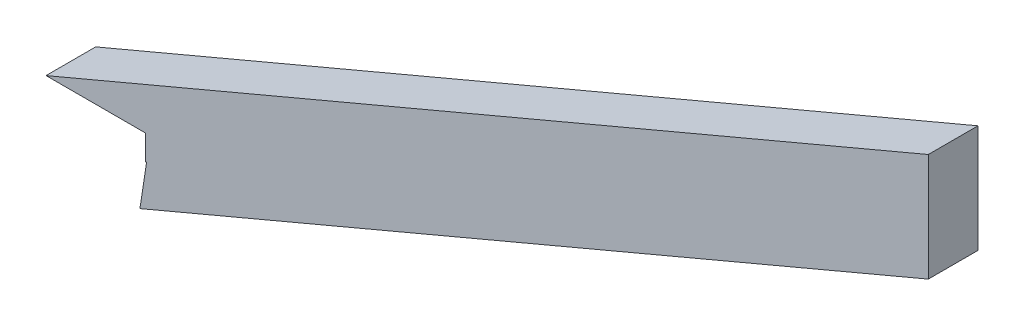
ISO-10303-21;
HEADER;
FILE_DESCRIPTION(('STEP AP214'),'2;1');
FILE_NAME('part.step','',(''),(''),'','','');
FILE_SCHEMA(('AUTOMOTIVE_DESIGN { 1 0 10303 214 1 1 1 1 }'));
ENDSEC;
DATA;
#1=APPLICATION_CONTEXT('core data for automotive mechanical design processes');
#2=APPLICATION_PROTOCOL_DEFINITION('international standard','automotive_design',2000,#1);
#3=PRODUCT_CONTEXT('',#1,'mechanical');
#4=PRODUCT('Part','Part','',(#3));
#5=PRODUCT_RELATED_PRODUCT_CATEGORY('part','',(#4));
#6=PRODUCT_DEFINITION_FORMATION('','',#4);
#7=PRODUCT_DEFINITION_CONTEXT('part definition',#1,'design');
#8=PRODUCT_DEFINITION('design','',#6,#7);
#9=PRODUCT_DEFINITION_SHAPE('','',#8);
#10=(LENGTH_UNIT() NAMED_UNIT(*) SI_UNIT(.MILLI.,.METRE.));
#11=(NAMED_UNIT(*) PLANE_ANGLE_UNIT() SI_UNIT($,.RADIAN.));
#12=(NAMED_UNIT(*) SI_UNIT($,.STERADIAN.) SOLID_ANGLE_UNIT());
#13=UNCERTAINTY_MEASURE_WITH_UNIT(LENGTH_MEASURE(1.E-05),#10,'distance_accuracy_value','');
#14=(GEOMETRIC_REPRESENTATION_CONTEXT(3) GLOBAL_UNCERTAINTY_ASSIGNED_CONTEXT((#13)) GLOBAL_UNIT_ASSIGNED_CONTEXT((#10,
#11,#12)) REPRESENTATION_CONTEXT('',''));
#15=CARTESIAN_POINT('',(0.,0.,0.));
#16=DIRECTION('',(0.,0.,1.));
#17=DIRECTION('',(1.,0.,0.));
#18=AXIS2_PLACEMENT_3D('',#15,#16,#17);
#19=CARTESIAN_POINT('',(-812.8,0.,50.8));
#20=DIRECTION('',(0.,1.,0.));
#21=DIRECTION('',(-1.,0.,0.));
#22=AXIS2_PLACEMENT_3D('',#19,#20,#21);
#23=PLANE('',#22);
#24=DIRECTION('',(1.,0.,0.));
#25=VECTOR('',#24,1.);
#26=CARTESIAN_POINT('',(-812.8,0.,0.));
#27=LINE('',#26,#25);
#28=CARTESIAN_POINT('',(-812.8,0.,0.));
#29=VERTEX_POINT('',#28);
#30=CARTESIAN_POINT('',(-811.604664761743,-1.11022302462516E-13,0.));
#31=VERTEX_POINT('',#30);
#32=EDGE_CURVE('E123',#29,#31,#27,.T.);
#33=ORIENTED_EDGE('',*,*,#32,.T.);
#34=DIRECTION('',(0.,0.,-1.));
#35=VECTOR('',#34,1.);
#36=CARTESIAN_POINT('',(-811.604664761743,-1.11022302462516E-13,50.8));
#37=LINE('',#36,#35);
#38=CARTESIAN_POINT('',(-811.604664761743,-1.11022302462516E-13,50.8));
#39=VERTEX_POINT('',#38);
#40=EDGE_CURVE('E11',#39,#31,#37,.T.);
#41=ORIENTED_EDGE('',*,*,#40,.F.);
#42=DIRECTION('',(1.,0.,0.));
#43=VECTOR('',#42,1.);
#44=CARTESIAN_POINT('',(-812.8,0.,50.8));
#45=LINE('',#44,#43);
#46=CARTESIAN_POINT('',(-812.8,0.,50.8));
#47=VERTEX_POINT('',#46);
#48=EDGE_CURVE('E135',#47,#39,#45,.T.);
#49=ORIENTED_EDGE('',*,*,#48,.F.);
#50=DIRECTION('',(0.,0.,-1.));
#51=VECTOR('',#50,1.);
#52=CARTESIAN_POINT('',(-812.8,0.,50.8));
#53=LINE('',#52,#51);
#54=EDGE_CURVE('E119',#47,#29,#53,.T.);
#55=ORIENTED_EDGE('',*,*,#54,.T.);
#56=EDGE_LOOP('',(#33,#41,#49,#55));
#57=FACE_BOUND('',#56,.T.);
#58=ADVANCED_FACE('F33',(#57),#23,.F.);
#59=CARTESIAN_POINT('',(-811.604664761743,-1.11022302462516E-13,50.8));
#60=DIRECTION('',(0.988371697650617,-0.15205718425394,0.));
#61=DIRECTION('',(0.15205718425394,0.988371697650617,0.));
#62=AXIS2_PLACEMENT_3D('',#59,#60,#61);
#63=PLANE('',#62);
#64=DIRECTION('',(-0.15205718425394,-0.988371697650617,0.));
#65=VECTOR('',#64,1.);
#66=CARTESIAN_POINT('',(-811.604664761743,-1.11022302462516E-13,0.));
#67=LINE('',#66,#65);
#68=CARTESIAN_POINT('',(-818.427035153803,-44.345407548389,0.));
#69=VERTEX_POINT('',#68);
#70=EDGE_CURVE('E126',#31,#69,#67,.T.);
#71=ORIENTED_EDGE('',*,*,#70,.T.);
#72=DIRECTION('',(0.,0.,-1.));
#73=VECTOR('',#72,1.);
#74=CARTESIAN_POINT('',(-818.427035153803,-44.345407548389,50.8));
#75=LINE('',#74,#73);
#76=CARTESIAN_POINT('',(-818.427035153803,-44.345407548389,50.8));
#77=VERTEX_POINT('',#76);
#78=EDGE_CURVE('E41',#77,#69,#75,.T.);
#79=ORIENTED_EDGE('',*,*,#78,.F.);
#80=DIRECTION('',(-0.15205718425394,-0.988371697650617,0.));
#81=VECTOR('',#80,1.);
#82=CARTESIAN_POINT('',(-811.604664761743,-1.11022302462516E-13,50.8));
#83=LINE('',#82,#81);
#84=EDGE_CURVE('E89',#39,#77,#83,.T.);
#85=ORIENTED_EDGE('',*,*,#84,.F.);
#86=ORIENTED_EDGE('',*,*,#40,.T.);
#87=EDGE_LOOP('',(#71,#79,#85,#86));
#88=FACE_BOUND('',#87,.T.);
#89=ADVANCED_FACE('F160',(#88),#63,.F.);
#90=CARTESIAN_POINT('',(-818.427035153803,-44.345407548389,50.8));
#91=DIRECTION('',(-0.389216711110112,0.921146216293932,0.));
#92=DIRECTION('',(-0.921146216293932,-0.389216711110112,0.));
#93=AXIS2_PLACEMENT_3D('',#90,#91,#92);
#94=PLANE('',#93);
#95=DIRECTION('',(0.921146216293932,0.389216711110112,0.));
#96=VECTOR('',#95,1.);
#97=CARTESIAN_POINT('',(-818.427035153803,-44.345407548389,0.));
#98=LINE('',#97,#96);
#99=CARTESIAN_POINT('',(-12.7000000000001,296.102635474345,0.));
#100=VERTEX_POINT('',#99);
#101=EDGE_CURVE('E128',#69,#100,#98,.T.);
#102=ORIENTED_EDGE('',*,*,#101,.T.);
#103=DIRECTION('',(0.,0.,-1.));
#104=VECTOR('',#103,1.);
#105=CARTESIAN_POINT('',(-12.7000000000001,296.102635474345,50.8));
#106=LINE('',#105,#104);
#107=CARTESIAN_POINT('',(-12.7000000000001,296.102635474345,50.8));
#108=VERTEX_POINT('',#107);
#109=EDGE_CURVE('E139',#108,#100,#106,.T.);
#110=ORIENTED_EDGE('',*,*,#109,.F.);
#111=DIRECTION('',(0.921146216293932,0.389216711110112,0.));
#112=VECTOR('',#111,1.);
#113=CARTESIAN_POINT('',(-818.427035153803,-44.345407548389,50.8));
#114=LINE('',#113,#112);
#115=EDGE_CURVE('E147',#77,#108,#114,.T.);
#116=ORIENTED_EDGE('',*,*,#115,.F.);
#117=ORIENTED_EDGE('',*,*,#78,.T.);
#118=EDGE_LOOP('',(#102,#110,#116,#117));
#119=FACE_BOUND('',#118,.T.);
#120=ADVANCED_FACE('F145',(#119),#94,.F.);
#121=CARTESIAN_POINT('',(-12.7,406.4,50.8));
#122=DIRECTION('',(-1.,0.,0.));
#123=DIRECTION('',(0.,-1.,0.));
#124=AXIS2_PLACEMENT_3D('',#121,#122,#123);
#125=PLANE('',#124);
#126=DIRECTION('',(0.,1.,0.));
#127=VECTOR('',#126,1.);
#128=CARTESIAN_POINT('',(-12.7,406.4,0.));
#129=LINE('',#128,#127);
#130=CARTESIAN_POINT('',(-12.7,406.4,0.));
#131=VERTEX_POINT('',#130);
#132=EDGE_CURVE('E130',#100,#131,#129,.T.);
#133=ORIENTED_EDGE('',*,*,#132,.T.);
#134=DIRECTION('',(0.,0.,-1.));
#135=VECTOR('',#134,1.);
#136=CARTESIAN_POINT('',(-12.7,406.4,50.8));
#137=LINE('',#136,#135);
#138=CARTESIAN_POINT('',(-12.7,406.4,50.8));
#139=VERTEX_POINT('',#138);
#140=EDGE_CURVE('E114',#139,#131,#137,.T.);
#141=ORIENTED_EDGE('',*,*,#140,.F.);
#142=DIRECTION('',(0.,1.,0.));
#143=VECTOR('',#142,1.);
#144=CARTESIAN_POINT('',(-12.7,406.4,50.8));
#145=LINE('',#144,#143);
#146=EDGE_CURVE('E105',#108,#139,#145,.T.);
#147=ORIENTED_EDGE('',*,*,#146,.F.);
#148=ORIENTED_EDGE('',*,*,#109,.T.);
#149=EDGE_LOOP('',(#133,#141,#147,#148));
#150=FACE_BOUND('',#149,.T.);
#151=ADVANCED_FACE('F153',(#150),#125,.F.);
#152=CARTESIAN_POINT('',(-914.4,25.4,50.8));
#153=DIRECTION('',(0.389216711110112,-0.921146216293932,0.));
#154=DIRECTION('',(0.921146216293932,0.389216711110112,0.));
#155=AXIS2_PLACEMENT_3D('',#152,#153,#154);
#156=PLANE('',#155);
#157=DIRECTION('',(-0.921146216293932,-0.389216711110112,0.));
#158=VECTOR('',#157,1.);
#159=CARTESIAN_POINT('',(-914.4,25.4,0.));
#160=LINE('',#159,#158);
#161=CARTESIAN_POINT('',(-914.4,25.4,0.));
#162=VERTEX_POINT('',#161);
#163=EDGE_CURVE('E113',#131,#162,#160,.T.);
#164=ORIENTED_EDGE('',*,*,#163,.T.);
#165=DIRECTION('',(0.,0.,-1.));
#166=VECTOR('',#165,1.);
#167=CARTESIAN_POINT('',(-914.4,25.4,50.8));
#168=LINE('',#167,#166);
#169=CARTESIAN_POINT('',(-914.4,25.4,50.8));
#170=VERTEX_POINT('',#169);
#171=EDGE_CURVE('E110',#170,#162,#168,.T.);
#172=ORIENTED_EDGE('',*,*,#171,.F.);
#173=DIRECTION('',(-0.921146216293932,-0.389216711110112,0.));
#174=VECTOR('',#173,1.);
#175=CARTESIAN_POINT('',(-914.4,25.4,50.8));
#176=LINE('',#175,#174);
#177=EDGE_CURVE('E99',#139,#170,#176,.T.);
#178=ORIENTED_EDGE('',*,*,#177,.F.);
#179=ORIENTED_EDGE('',*,*,#140,.T.);
#180=EDGE_LOOP('',(#164,#172,#178,#179));
#181=FACE_BOUND('',#180,.T.);
#182=ADVANCED_FACE('F111',(#181),#156,.F.);
#183=CARTESIAN_POINT('',(-914.4,25.4,50.8));
#184=DIRECTION('',(0.,1.,0.));
#185=DIRECTION('',(0.,0.,1.));
#186=AXIS2_PLACEMENT_3D('',#183,#184,#185);
#187=PLANE('',#186);
#188=DIRECTION('',(1.,0.,0.));
#189=VECTOR('',#188,1.);
#190=CARTESIAN_POINT('',(-914.4,25.4,0.));
#191=LINE('',#190,#189);
#192=CARTESIAN_POINT('',(-812.8,25.4,0.));
#193=VERTEX_POINT('',#192);
#194=EDGE_CURVE('E75',#162,#193,#191,.T.);
#195=ORIENTED_EDGE('',*,*,#194,.T.);
#196=DIRECTION('',(0.,0.,-1.));
#197=VECTOR('',#196,1.);
#198=CARTESIAN_POINT('',(-812.8,25.4,50.8));
#199=LINE('',#198,#197);
#200=CARTESIAN_POINT('',(-812.8,25.4,50.8));
#201=VERTEX_POINT('',#200);
#202=EDGE_CURVE('E115',#201,#193,#199,.T.);
#203=ORIENTED_EDGE('',*,*,#202,.F.);
#204=DIRECTION('',(1.,0.,0.));
#205=VECTOR('',#204,1.);
#206=CARTESIAN_POINT('',(-914.4,25.4,50.8));
#207=LINE('',#206,#205);
#208=EDGE_CURVE('E103',#170,#201,#207,.T.);
#209=ORIENTED_EDGE('',*,*,#208,.F.);
#210=ORIENTED_EDGE('',*,*,#171,.T.);
#211=EDGE_LOOP('',(#195,#203,#209,#210));
#212=FACE_BOUND('',#211,.T.);
#213=ADVANCED_FACE('F117',(#212),#187,.F.);
#214=CARTESIAN_POINT('',(-812.8,25.4,50.8));
#215=DIRECTION('',(1.,0.,0.));
#216=DIRECTION('',(0.,0.,-1.));
#217=AXIS2_PLACEMENT_3D('',#214,#215,#216);
#218=PLANE('',#217);
#219=DIRECTION('',(0.,-1.,0.));
#220=VECTOR('',#219,1.);
#221=CARTESIAN_POINT('',(-812.8,25.4,0.));
#222=LINE('',#221,#220);
#223=EDGE_CURVE('E81',#193,#29,#222,.T.);
#224=ORIENTED_EDGE('',*,*,#223,.T.);
#225=ORIENTED_EDGE('',*,*,#54,.F.);
#226=DIRECTION('',(0.,-1.,0.));
#227=VECTOR('',#226,1.);
#228=CARTESIAN_POINT('',(-812.8,25.4,50.8));
#229=LINE('',#228,#227);
#230=EDGE_CURVE('E49',#201,#47,#229,.T.);
#231=ORIENTED_EDGE('',*,*,#230,.F.);
#232=ORIENTED_EDGE('',*,*,#202,.T.);
#233=EDGE_LOOP('',(#224,#225,#231,#232));
#234=FACE_BOUND('',#233,.T.);
#235=ADVANCED_FACE('F174',(#234),#218,.F.);
#236=CARTESIAN_POINT('',(0.,0.,50.8));
#237=DIRECTION('',(0.,0.,-1.));
#238=DIRECTION('',(-1.,0.,0.));
#239=AXIS2_PLACEMENT_3D('',#236,#237,#238);
#240=PLANE('',#239);
#241=ORIENTED_EDGE('',*,*,#48,.T.);
#242=ORIENTED_EDGE('',*,*,#84,.T.);
#243=ORIENTED_EDGE('',*,*,#115,.T.);
#244=ORIENTED_EDGE('',*,*,#146,.T.);
#245=ORIENTED_EDGE('',*,*,#177,.T.);
#246=ORIENTED_EDGE('',*,*,#208,.T.);
#247=ORIENTED_EDGE('',*,*,#230,.T.);
#248=EDGE_LOOP('',(#241,#242,#243,#244,#245,#246,#247));
#249=FACE_BOUND('',#248,.T.);
#250=ADVANCED_FACE('F101',(#249),#240,.F.);
#251=CARTESIAN_POINT('',(0.,0.,0.));
#252=DIRECTION('',(0.,0.,-1.));
#253=DIRECTION('',(-1.,0.,0.));
#254=AXIS2_PLACEMENT_3D('',#251,#252,#253);
#255=PLANE('',#254);
#256=ORIENTED_EDGE('',*,*,#32,.F.);
#257=ORIENTED_EDGE('',*,*,#223,.F.);
#258=ORIENTED_EDGE('',*,*,#194,.F.);
#259=ORIENTED_EDGE('',*,*,#163,.F.);
#260=ORIENTED_EDGE('',*,*,#132,.F.);
#261=ORIENTED_EDGE('',*,*,#101,.F.);
#262=ORIENTED_EDGE('',*,*,#70,.F.);
#263=EDGE_LOOP('',(#256,#257,#258,#259,#260,#261,#262));
#264=FACE_BOUND('',#263,.T.);
#265=ADVANCED_FACE('F151',(#264),#255,.T.);
#266=CLOSED_SHELL('',(#58,#89,#120,#151,#182,#213,#235,#250,#265));
#267=MANIFOLD_SOLID_BREP('B2',#266);
#268=ADVANCED_BREP_SHAPE_REPRESENTATION('',(#18,#267),#14);
#269=SHAPE_DEFINITION_REPRESENTATION(#9,#268);
ENDSEC;
END-ISO-10303-21;
